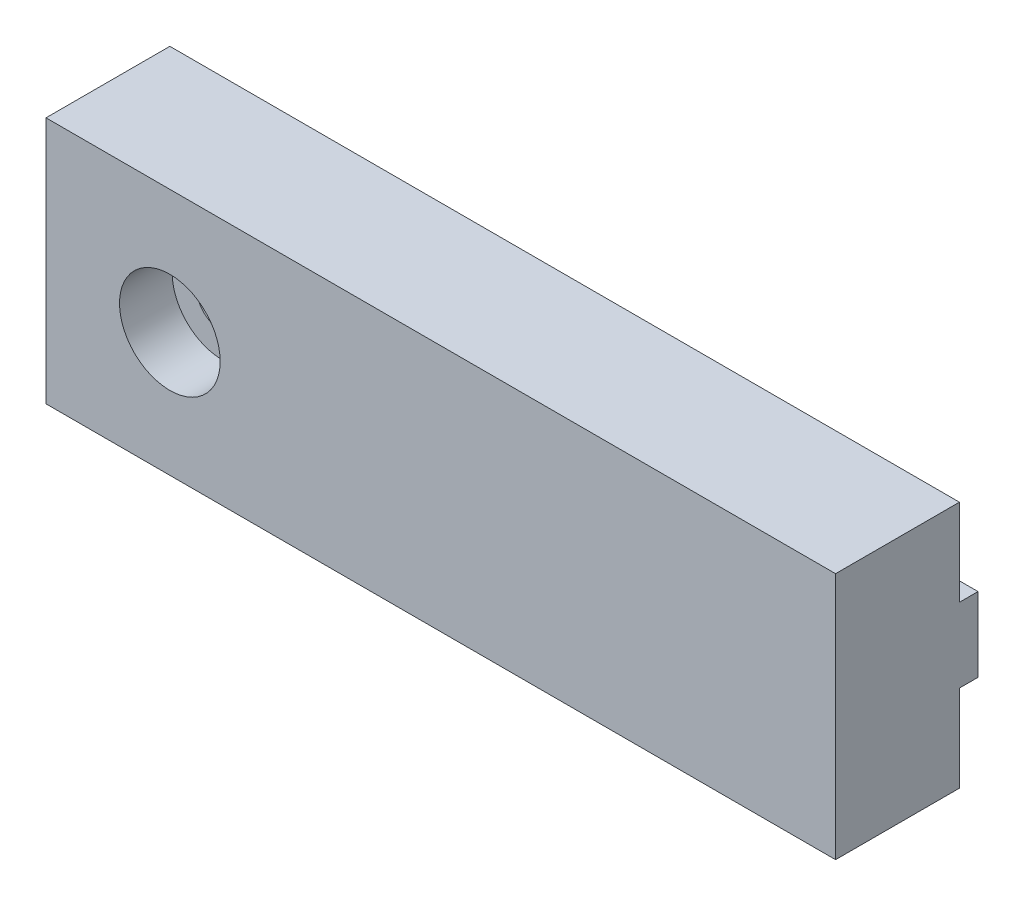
from build123d import *

# Parameters (mm, degrees)
SKIZZE1_W                                            = 51
SKIZZE1_H                                            = 16
AUFSATZ_LINEAR_AUSTRAGEN1_DEPTH                      = 8
SKIZZE2_W                                            = 51
SKIZZE2_H                                            = 4.8
AUFSATZ_LINEAR_AUSTRAGEN2_DEPTH                      = 1.2
STIRNSENKUNG_F_R_M3_ZYLINDERSCHRAUBE_MIT_D           = 3.4
STIRNSENKUNG_F_R_M3_ZYLINDERSCHRAUBE_MIT_CBORE_D     = 6.5
STIRNSENKUNG_F_R_M3_ZYLINDERSCHRAUBE_MIT_CBORE_DEPTH = 3.4


with BuildPart() as part:
    # Skizze1 → Aufsatz-Linear austragen1 (new body)
    with BuildSketch(Plane.XY):
        Rectangle(SKIZZE1_W, SKIZZE1_H)
    extrude(amount=AUFSATZ_LINEAR_AUSTRAGEN1_DEPTH)

    # Skizze2 → Aufsatz-Linear austragen2 (add)
    with BuildSketch(Plane(origin=(0, 0, 0), x_dir=(-1, 0, 0), z_dir=(0, 0, -1))):
        Rectangle(SKIZZE2_W, SKIZZE2_H)
    extrude(amount=AUFSATZ_LINEAR_AUSTRAGEN2_DEPTH)

    # Stirnsenkung f_r M3 Zylinderschraube mit (through all)
    with Locations(Plane.XY.offset(8)):
        with Locations((-17.5, 0)):
            CounterBoreHole(STIRNSENKUNG_F_R_M3_ZYLINDERSCHRAUBE_MIT_D / 2, STIRNSENKUNG_F_R_M3_ZYLINDERSCHRAUBE_MIT_CBORE_D / 2, STIRNSENKUNG_F_R_M3_ZYLINDERSCHRAUBE_MIT_CBORE_DEPTH)


solid = part.part
